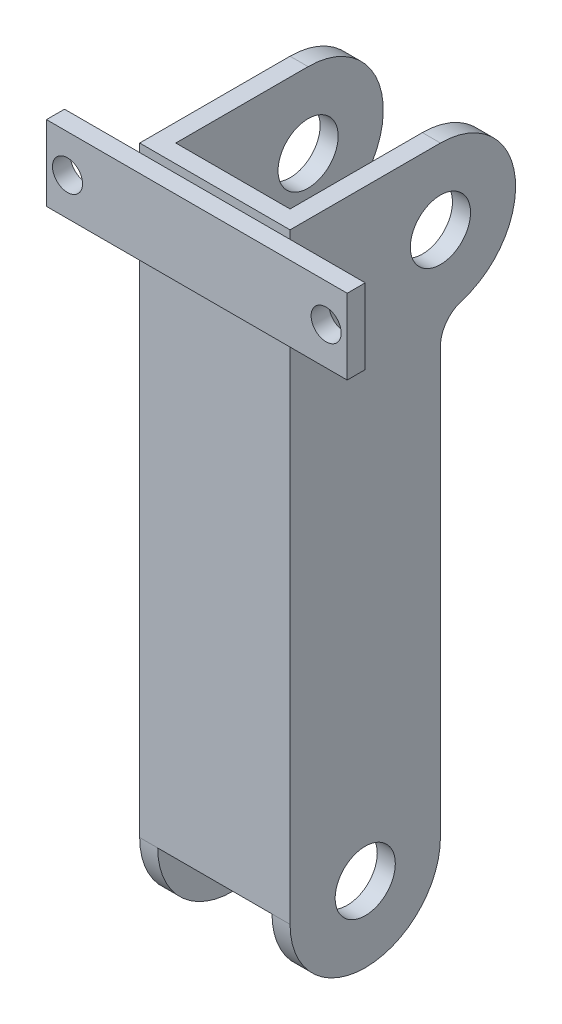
from build123d import *

# Parameters (mm, degrees)
SKETCH1_R           = 10
BOSS_EXTRUDE1_DEPTH = 6
SKETCH6_W           = 50
SKETCH6_H           = 200
BOSS_EXTRUDE5_DEPTH = 6
SKETCH10_W          = 100
SKETCH10_H          = 25
SKETCH10_R          = 5
BOSS_EXTRUDE6_DEPTH = 6


with BuildPart() as part:
    # Sketch1 → Boss-Extrude1 (new body)
    with BuildSketch(Plane(origin=(0, 0, 0), x_dir=(0, 0, -1), z_dir=(1, 0, 0))):
        with BuildLine():
            Line((25, 0), (25, 141.458980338))
            ThreePointArc((25, 141.458980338), (26.982162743, 147.435123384), (32.142857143, 151.042128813))
            ThreePointArc((32.142857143, 151.042128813), (49.738095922, 178.609239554), (25, 200))
            Line((25, 200), (-25, 200))
            Line((-25, 200), (-25, 0))
            ThreePointArc((-25, 0), (0, -25), (25, 0))
        make_face()
        Circle(SKETCH1_R, mode=Mode.SUBTRACT)
        with Locations((25, 175)):
            Circle(SKETCH1_R, mode=Mode.SUBTRACT)
    boss_extrude1 = extrude(amount=BOSS_EXTRUDE1_DEPTH)

    # Sketch6 → Boss-Extrude5 (add)
    with BuildSketch(Plane.XY.offset(25)):
        with Locations((25, 100)):
            Rectangle(SKETCH6_W, SKETCH6_H)
    extrude(amount=-BOSS_EXTRUDE5_DEPTH)

    # Mirror1: Boss-Extrude1 across plane
    add(boss_extrude1.mirror(Plane.ZY.offset(-25)))

    # Sketch10 → Boss-Extrude6 (add)
    with BuildSketch(Plane.XY.offset(25)):
        with Locations((25, 184.744241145)):
            Rectangle(SKETCH10_W, SKETCH10_H)
        with Locations((-18, 184.744241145)):
            Circle(SKETCH10_R, mode=Mode.SUBTRACT)
        with Locations(Location((68, 184.744241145, 0), (0, 0, 180))):
            Circle(SKETCH10_R, mode=Mode.SUBTRACT)
    extrude(amount=BOSS_EXTRUDE6_DEPTH)


solid = part.part
